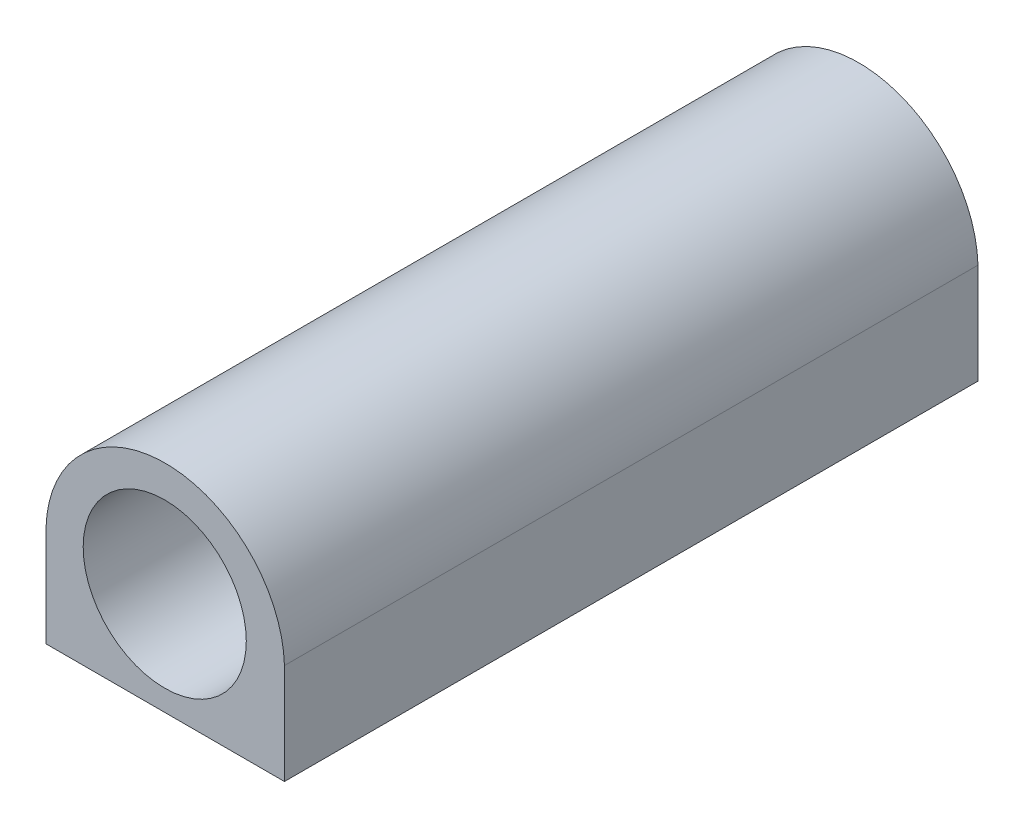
ISO-10303-21;
HEADER;
FILE_DESCRIPTION(('STEP AP214'),'2;1');
FILE_NAME('part.step','',(''),(''),'','','');
FILE_SCHEMA(('AUTOMOTIVE_DESIGN { 1 0 10303 214 1 1 1 1 }'));
ENDSEC;
DATA;
#1=APPLICATION_CONTEXT('core data for automotive mechanical design processes');
#2=APPLICATION_PROTOCOL_DEFINITION('international standard','automotive_design',2000,#1);
#3=PRODUCT_CONTEXT('',#1,'mechanical');
#4=PRODUCT('Part','Part','',(#3));
#5=PRODUCT_RELATED_PRODUCT_CATEGORY('part','',(#4));
#6=PRODUCT_DEFINITION_FORMATION('','',#4);
#7=PRODUCT_DEFINITION_CONTEXT('part definition',#1,'design');
#8=PRODUCT_DEFINITION('design','',#6,#7);
#9=PRODUCT_DEFINITION_SHAPE('','',#8);
#10=(LENGTH_UNIT() NAMED_UNIT(*) SI_UNIT(.MILLI.,.METRE.));
#11=(NAMED_UNIT(*) PLANE_ANGLE_UNIT() SI_UNIT($,.RADIAN.));
#12=(NAMED_UNIT(*) SI_UNIT($,.STERADIAN.) SOLID_ANGLE_UNIT());
#13=UNCERTAINTY_MEASURE_WITH_UNIT(LENGTH_MEASURE(1.E-05),#10,'distance_accuracy_value','');
#14=(GEOMETRIC_REPRESENTATION_CONTEXT(3) GLOBAL_UNCERTAINTY_ASSIGNED_CONTEXT((#13)) GLOBAL_UNIT_ASSIGNED_CONTEXT((#10,
#11,#12)) REPRESENTATION_CONTEXT('',''));
#15=CARTESIAN_POINT('',(0.,0.,0.));
#16=DIRECTION('',(0.,0.,1.));
#17=DIRECTION('',(1.,0.,0.));
#18=AXIS2_PLACEMENT_3D('',#15,#16,#17);
#19=CARTESIAN_POINT('',(-76.2611931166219,40.2415150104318,-84.8470907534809));
#20=DIRECTION('',(0.,0.,1.));
#21=DIRECTION('',(1.,0.,0.));
#22=AXIS2_PLACEMENT_3D('',#19,#20,#21);
#23=CYLINDRICAL_SURFACE('',#22,12.7);
#24=CARTESIAN_POINT('',(-76.2611931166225,40.2415150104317,3.6422428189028));
#25=DIRECTION('',(0.,0.,1.));
#26=DIRECTION('',(1.,0.,0.));
#27=AXIS2_PLACEMENT_3D('',#24,#25,#26);
#28=CIRCLE('',#27,12.7);
#29=CARTESIAN_POINT('',(-63.5611931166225,40.2415150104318,3.6422428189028));
#30=VERTEX_POINT('',#29);
#31=EDGE_CURVE('E10',#30,#30,#28,.T.);
#32=ORIENTED_EDGE('',*,*,#31,.T.);
#33=EDGE_LOOP('',(#32));
#34=FACE_BOUND('',#33,.T.);
#35=CARTESIAN_POINT('',(-76.2611931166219,40.2415150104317,-84.8470907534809));
#36=DIRECTION('',(0.,0.,-1.));
#37=DIRECTION('',(0.,-1.,0.));
#38=AXIS2_PLACEMENT_3D('',#35,#36,#37);
#39=CIRCLE('',#38,12.7);
#40=CARTESIAN_POINT('',(-76.2611931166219,27.5415150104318,-84.8470907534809));
#41=VERTEX_POINT('',#40);
#42=EDGE_CURVE('E26',#41,#41,#39,.T.);
#43=ORIENTED_EDGE('',*,*,#42,.T.);
#44=EDGE_LOOP('',(#43));
#45=FACE_BOUND('',#44,.T.);
#46=ADVANCED_FACE('F16',(#34,#45),#23,.F.);
#47=CARTESIAN_POINT('',(-545.084032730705,24.2776075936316,245.712893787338));
#48=DIRECTION('',(0.,-1.,0.));
#49=DIRECTION('',(1.,0.,0.));
#50=AXIS2_PLACEMENT_3D('',#47,#48,#49);
#51=PLANE('',#50);
#52=DIRECTION('',(1.,0.,0.));
#53=VECTOR('',#52,1.);
#54=CARTESIAN_POINT('',(-94.7515980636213,24.2776075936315,3.64224281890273));
#55=LINE('',#54,#53);
#56=CARTESIAN_POINT('',(-94.7515980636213,24.2776075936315,3.64224281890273));
#57=VERTEX_POINT('',#56);
#58=CARTESIAN_POINT('',(-57.6183881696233,24.2776075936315,3.64224281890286));
#59=VERTEX_POINT('',#58);
#60=EDGE_CURVE('E83',#57,#59,#55,.T.);
#61=ORIENTED_EDGE('',*,*,#60,.F.);
#62=DIRECTION('',(0.,0.,1.));
#63=VECTOR('',#62,1.);
#64=CARTESIAN_POINT('',(-94.7515980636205,24.2776075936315,-104.357657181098));
#65=LINE('',#64,#63);
#66=CARTESIAN_POINT('',(-94.7515980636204,24.2776075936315,-104.357657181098));
#67=VERTEX_POINT('',#66);
#68=EDGE_CURVE('E35',#67,#57,#65,.T.);
#69=ORIENTED_EDGE('',*,*,#68,.F.);
#70=DIRECTION('',(-1.,0.,0.));
#71=VECTOR('',#70,1.);
#72=CARTESIAN_POINT('',(-57.6183881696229,24.2776075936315,-104.357657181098));
#73=LINE('',#72,#71);
#74=CARTESIAN_POINT('',(-57.6183881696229,24.2776075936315,-104.357657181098));
#75=VERTEX_POINT('',#74);
#76=EDGE_CURVE('E71',#75,#67,#73,.T.);
#77=ORIENTED_EDGE('',*,*,#76,.F.);
#78=DIRECTION('',(0.,0.,1.));
#79=VECTOR('',#78,1.);
#80=CARTESIAN_POINT('',(-57.618388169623,24.2776075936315,-104.357657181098));
#81=LINE('',#80,#79);
#82=EDGE_CURVE('E86',#75,#59,#81,.T.);
#83=ORIENTED_EDGE('',*,*,#82,.T.);
#84=EDGE_LOOP('',(#61,#69,#77,#83));
#85=FACE_BOUND('',#84,.T.);
#86=CARTESIAN_POINT('',(-76.1849931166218,24.2776075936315,-89.3576571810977));
#87=DIRECTION('',(0.,-1.,0.));
#88=DIRECTION('',(-1.,0.,0.));
#89=AXIS2_PLACEMENT_3D('',#86,#87,#88);
#90=CIRCLE('',#89,2.);
#91=CARTESIAN_POINT('',(-78.1849931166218,24.2776075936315,-89.3576571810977));
#92=VERTEX_POINT('',#91);
#93=EDGE_CURVE('E90',#92,#92,#90,.T.);
#94=ORIENTED_EDGE('',*,*,#93,.F.);
#95=EDGE_LOOP('',(#94));
#96=FACE_BOUND('',#95,.T.);
#97=CARTESIAN_POINT('',(-85.4682955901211,24.2776075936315,-99.3576571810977));
#98=DIRECTION('',(0.,-1.,0.));
#99=DIRECTION('',(-1.,0.,0.));
#100=AXIS2_PLACEMENT_3D('',#97,#98,#99);
#101=CIRCLE('',#100,2.);
#102=CARTESIAN_POINT('',(-87.4682955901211,24.2776075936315,-99.3576571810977));
#103=VERTEX_POINT('',#102);
#104=EDGE_CURVE('E95',#103,#103,#101,.T.);
#105=ORIENTED_EDGE('',*,*,#104,.F.);
#106=EDGE_LOOP('',(#105));
#107=FACE_BOUND('',#106,.T.);
#108=CARTESIAN_POINT('',(-66.9016906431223,24.2776075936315,-99.3576571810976));
#109=DIRECTION('',(0.,-1.,0.));
#110=DIRECTION('',(-1.,0.,0.));
#111=AXIS2_PLACEMENT_3D('',#108,#109,#110);
#112=CIRCLE('',#111,2.);
#113=CARTESIAN_POINT('',(-68.9016906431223,24.2776075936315,-99.3576571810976));
#114=VERTEX_POINT('',#113);
#115=EDGE_CURVE('E99',#114,#114,#112,.T.);
#116=ORIENTED_EDGE('',*,*,#115,.F.);
#117=EDGE_LOOP('',(#116));
#118=FACE_BOUND('',#117,.T.);
#119=CARTESIAN_POINT('',(-76.1849931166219,24.2776075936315,-79.3576571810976));
#120=DIRECTION('',(0.,-1.,0.));
#121=DIRECTION('',(-1.,0.,0.));
#122=AXIS2_PLACEMENT_3D('',#119,#120,#121);
#123=CIRCLE('',#122,2.);
#124=CARTESIAN_POINT('',(-78.1849931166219,24.2776075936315,-79.3576571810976));
#125=VERTEX_POINT('',#124);
#126=EDGE_CURVE('E102',#125,#125,#123,.T.);
#127=ORIENTED_EDGE('',*,*,#126,.F.);
#128=EDGE_LOOP('',(#127));
#129=FACE_BOUND('',#128,.T.);
#130=CARTESIAN_POINT('',(-85.4682955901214,24.2776075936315,-69.3576571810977));
#131=DIRECTION('',(0.,-1.,0.));
#132=DIRECTION('',(-1.,0.,0.));
#133=AXIS2_PLACEMENT_3D('',#130,#131,#132);
#134=CIRCLE('',#133,2.);
#135=CARTESIAN_POINT('',(-87.4682955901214,24.2776075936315,-69.3576571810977));
#136=VERTEX_POINT('',#135);
#137=EDGE_CURVE('E107',#136,#136,#134,.T.);
#138=ORIENTED_EDGE('',*,*,#137,.F.);
#139=EDGE_LOOP('',(#138));
#140=FACE_BOUND('',#139,.T.);
#141=CARTESIAN_POINT('',(-66.9016906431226,24.2776075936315,-69.3576571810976));
#142=DIRECTION('',(0.,-1.,0.));
#143=DIRECTION('',(-1.,0.,0.));
#144=AXIS2_PLACEMENT_3D('',#141,#142,#143);
#145=CIRCLE('',#144,2.);
#146=CARTESIAN_POINT('',(-68.9016906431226,24.2776075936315,-69.3576571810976));
#147=VERTEX_POINT('',#146);
#148=EDGE_CURVE('E111',#147,#147,#145,.T.);
#149=ORIENTED_EDGE('',*,*,#148,.F.);
#150=EDGE_LOOP('',(#149));
#151=FACE_BOUND('',#150,.T.);
#152=CARTESIAN_POINT('',(-76.1849931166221,24.2776075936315,-59.3576571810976));
#153=DIRECTION('',(0.,-1.,0.));
#154=DIRECTION('',(-1.,0.,0.));
#155=AXIS2_PLACEMENT_3D('',#152,#153,#154);
#156=CIRCLE('',#155,2.);
#157=CARTESIAN_POINT('',(-78.1849931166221,24.2776075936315,-59.3576571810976));
#158=VERTEX_POINT('',#157);
#159=EDGE_CURVE('E115',#158,#158,#156,.T.);
#160=ORIENTED_EDGE('',*,*,#159,.F.);
#161=EDGE_LOOP('',(#160));
#162=FACE_BOUND('',#161,.T.);
#163=CARTESIAN_POINT('',(-85.4682955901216,24.2776075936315,-49.3576571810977));
#164=DIRECTION('',(0.,-1.,0.));
#165=DIRECTION('',(-1.,0.,0.));
#166=AXIS2_PLACEMENT_3D('',#163,#164,#165);
#167=CIRCLE('',#166,2.);
#168=CARTESIAN_POINT('',(-87.4682955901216,24.2776075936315,-49.3576571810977));
#169=VERTEX_POINT('',#168);
#170=EDGE_CURVE('E119',#169,#169,#167,.T.);
#171=ORIENTED_EDGE('',*,*,#170,.F.);
#172=EDGE_LOOP('',(#171));
#173=FACE_BOUND('',#172,.T.);
#174=CARTESIAN_POINT('',(-66.9016906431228,24.2776075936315,-49.3576571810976));
#175=DIRECTION('',(0.,-1.,0.));
#176=DIRECTION('',(-1.,0.,0.));
#177=AXIS2_PLACEMENT_3D('',#174,#175,#176);
#178=CIRCLE('',#177,2.);
#179=CARTESIAN_POINT('',(-68.9016906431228,24.2776075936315,-49.3576571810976));
#180=VERTEX_POINT('',#179);
#181=EDGE_CURVE('E123',#180,#180,#178,.T.);
#182=ORIENTED_EDGE('',*,*,#181,.F.);
#183=EDGE_LOOP('',(#182));
#184=FACE_BOUND('',#183,.T.);
#185=CARTESIAN_POINT('',(-76.1849931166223,24.2776075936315,-39.3576571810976));
#186=DIRECTION('',(0.,-1.,0.));
#187=DIRECTION('',(-1.,0.,0.));
#188=AXIS2_PLACEMENT_3D('',#185,#186,#187);
#189=CIRCLE('',#188,2.);
#190=CARTESIAN_POINT('',(-78.1849931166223,24.2776075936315,-39.3576571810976));
#191=VERTEX_POINT('',#190);
#192=EDGE_CURVE('E127',#191,#191,#189,.T.);
#193=ORIENTED_EDGE('',*,*,#192,.F.);
#194=EDGE_LOOP('',(#193));
#195=FACE_BOUND('',#194,.T.);
#196=CARTESIAN_POINT('',(-85.4682955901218,24.2776075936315,-29.3576571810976));
#197=DIRECTION('',(0.,-1.,0.));
#198=DIRECTION('',(-1.,0.,0.));
#199=AXIS2_PLACEMENT_3D('',#196,#197,#198);
#200=CIRCLE('',#199,2.);
#201=CARTESIAN_POINT('',(-87.4682955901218,24.2776075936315,-29.3576571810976));
#202=VERTEX_POINT('',#201);
#203=EDGE_CURVE('E131',#202,#202,#200,.T.);
#204=ORIENTED_EDGE('',*,*,#203,.F.);
#205=EDGE_LOOP('',(#204));
#206=FACE_BOUND('',#205,.T.);
#207=CARTESIAN_POINT('',(-66.9016906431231,24.2776075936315,-29.3576571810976));
#208=DIRECTION('',(0.,-1.,0.));
#209=DIRECTION('',(-1.,0.,0.));
#210=AXIS2_PLACEMENT_3D('',#207,#208,#209);
#211=CIRCLE('',#210,2.);
#212=CARTESIAN_POINT('',(-68.9016906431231,24.2776075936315,-29.3576571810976));
#213=VERTEX_POINT('',#212);
#214=EDGE_CURVE('E135',#213,#213,#211,.T.);
#215=ORIENTED_EDGE('',*,*,#214,.F.);
#216=EDGE_LOOP('',(#215));
#217=FACE_BOUND('',#216,.T.);
#218=CARTESIAN_POINT('',(-76.1849931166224,24.2776075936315,-29.3576571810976));
#219=DIRECTION('',(0.,-1.,0.));
#220=DIRECTION('',(-1.,0.,0.));
#221=AXIS2_PLACEMENT_3D('',#218,#219,#220);
#222=CIRCLE('',#221,2.);
#223=CARTESIAN_POINT('',(-78.1849931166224,24.2776075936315,-29.3576571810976));
#224=VERTEX_POINT('',#223);
#225=EDGE_CURVE('E134',#224,#224,#222,.T.);
#226=ORIENTED_EDGE('',*,*,#225,.F.);
#227=EDGE_LOOP('',(#226));
#228=FACE_BOUND('',#227,.T.);
#229=CARTESIAN_POINT('',(-66.901690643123,24.2776075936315,-39.3576571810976));
#230=DIRECTION('',(0.,-1.,0.));
#231=DIRECTION('',(-1.,0.,0.));
#232=AXIS2_PLACEMENT_3D('',#229,#230,#231);
#233=CIRCLE('',#232,2.);
#234=CARTESIAN_POINT('',(-68.901690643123,24.2776075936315,-39.3576571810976));
#235=VERTEX_POINT('',#234);
#236=EDGE_CURVE('E126',#235,#235,#233,.T.);
#237=ORIENTED_EDGE('',*,*,#236,.F.);
#238=EDGE_LOOP('',(#237));
#239=FACE_BOUND('',#238,.T.);
#240=CARTESIAN_POINT('',(-85.4682955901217,24.2776075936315,-39.3576571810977));
#241=DIRECTION('',(0.,-1.,0.));
#242=DIRECTION('',(-1.,0.,0.));
#243=AXIS2_PLACEMENT_3D('',#240,#241,#242);
#244=CIRCLE('',#243,2.);
#245=CARTESIAN_POINT('',(-87.4682955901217,24.2776075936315,-39.3576571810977));
#246=VERTEX_POINT('',#245);
#247=EDGE_CURVE('E130',#246,#246,#244,.T.);
#248=ORIENTED_EDGE('',*,*,#247,.F.);
#249=EDGE_LOOP('',(#248));
#250=FACE_BOUND('',#249,.T.);
#251=CARTESIAN_POINT('',(-76.1849931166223,24.2776075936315,-49.3576571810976));
#252=DIRECTION('',(0.,-1.,0.));
#253=DIRECTION('',(-1.,0.,0.));
#254=AXIS2_PLACEMENT_3D('',#251,#252,#253);
#255=CIRCLE('',#254,2.);
#256=CARTESIAN_POINT('',(-78.1849931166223,24.2776075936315,-49.3576571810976));
#257=VERTEX_POINT('',#256);
#258=EDGE_CURVE('E122',#257,#257,#255,.T.);
#259=ORIENTED_EDGE('',*,*,#258,.F.);
#260=EDGE_LOOP('',(#259));
#261=FACE_BOUND('',#260,.T.);
#262=CARTESIAN_POINT('',(-66.9016906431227,24.2776075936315,-59.3576571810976));
#263=DIRECTION('',(0.,-1.,0.));
#264=DIRECTION('',(-1.,0.,0.));
#265=AXIS2_PLACEMENT_3D('',#262,#263,#264);
#266=CIRCLE('',#265,2.);
#267=CARTESIAN_POINT('',(-68.9016906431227,24.2776075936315,-59.3576571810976));
#268=VERTEX_POINT('',#267);
#269=EDGE_CURVE('E114',#268,#268,#266,.T.);
#270=ORIENTED_EDGE('',*,*,#269,.F.);
#271=EDGE_LOOP('',(#270));
#272=FACE_BOUND('',#271,.T.);
#273=CARTESIAN_POINT('',(-85.4682955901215,24.2776075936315,-59.3576571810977));
#274=DIRECTION('',(0.,-1.,0.));
#275=DIRECTION('',(-1.,0.,0.));
#276=AXIS2_PLACEMENT_3D('',#273,#274,#275);
#277=CIRCLE('',#276,2.);
#278=CARTESIAN_POINT('',(-87.4682955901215,24.2776075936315,-59.3576571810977));
#279=VERTEX_POINT('',#278);
#280=EDGE_CURVE('E118',#279,#279,#277,.T.);
#281=ORIENTED_EDGE('',*,*,#280,.F.);
#282=EDGE_LOOP('',(#281));
#283=FACE_BOUND('',#282,.T.);
#284=CARTESIAN_POINT('',(-76.184993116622,24.2776075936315,-69.3576571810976));
#285=DIRECTION('',(0.,-1.,0.));
#286=DIRECTION('',(-1.,0.,0.));
#287=AXIS2_PLACEMENT_3D('',#284,#285,#286);
#288=CIRCLE('',#287,2.);
#289=CARTESIAN_POINT('',(-78.184993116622,24.2776075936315,-69.3576571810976));
#290=VERTEX_POINT('',#289);
#291=EDGE_CURVE('E110',#290,#290,#288,.T.);
#292=ORIENTED_EDGE('',*,*,#291,.F.);
#293=EDGE_LOOP('',(#292));
#294=FACE_BOUND('',#293,.T.);
#295=CARTESIAN_POINT('',(-66.9016906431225,24.2776075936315,-79.3576571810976));
#296=DIRECTION('',(0.,-1.,0.));
#297=DIRECTION('',(-1.,0.,0.));
#298=AXIS2_PLACEMENT_3D('',#295,#296,#297);
#299=CIRCLE('',#298,2.);
#300=CARTESIAN_POINT('',(-68.9016906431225,24.2776075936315,-79.3576571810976));
#301=VERTEX_POINT('',#300);
#302=EDGE_CURVE('E105',#301,#301,#299,.T.);
#303=ORIENTED_EDGE('',*,*,#302,.F.);
#304=EDGE_LOOP('',(#303));
#305=FACE_BOUND('',#304,.T.);
#306=CARTESIAN_POINT('',(-85.4682955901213,24.2776075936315,-79.3576571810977));
#307=DIRECTION('',(0.,-1.,0.));
#308=DIRECTION('',(-1.,0.,0.));
#309=AXIS2_PLACEMENT_3D('',#306,#307,#308);
#310=CIRCLE('',#309,2.);
#311=CARTESIAN_POINT('',(-87.4682955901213,24.2776075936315,-79.3576571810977));
#312=VERTEX_POINT('',#311);
#313=EDGE_CURVE('E106',#312,#312,#310,.T.);
#314=ORIENTED_EDGE('',*,*,#313,.F.);
#315=EDGE_LOOP('',(#314));
#316=FACE_BOUND('',#315,.T.);
#317=CARTESIAN_POINT('',(-76.1849931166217,24.2776075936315,-99.3576571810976));
#318=DIRECTION('',(0.,-1.,0.));
#319=DIRECTION('',(-1.,0.,0.));
#320=AXIS2_PLACEMENT_3D('',#317,#318,#319);
#321=CIRCLE('',#320,2.);
#322=CARTESIAN_POINT('',(-78.1849931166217,24.2776075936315,-99.3576571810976));
#323=VERTEX_POINT('',#322);
#324=EDGE_CURVE('E98',#323,#323,#321,.T.);
#325=ORIENTED_EDGE('',*,*,#324,.F.);
#326=EDGE_LOOP('',(#325));
#327=FACE_BOUND('',#326,.T.);
#328=CARTESIAN_POINT('',(-66.9016906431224,24.2776075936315,-89.3576571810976));
#329=DIRECTION('',(0.,-1.,0.));
#330=DIRECTION('',(-1.,0.,0.));
#331=AXIS2_PLACEMENT_3D('',#328,#329,#330);
#332=CIRCLE('',#331,2.);
#333=CARTESIAN_POINT('',(-68.9016906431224,24.2776075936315,-89.3576571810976));
#334=VERTEX_POINT('',#333);
#335=EDGE_CURVE('E94',#334,#334,#332,.T.);
#336=ORIENTED_EDGE('',*,*,#335,.F.);
#337=EDGE_LOOP('',(#336));
#338=FACE_BOUND('',#337,.T.);
#339=CARTESIAN_POINT('',(-85.4682955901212,24.2776075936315,-89.3576571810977));
#340=DIRECTION('',(0.,-1.,0.));
#341=DIRECTION('',(-1.,0.,0.));
#342=AXIS2_PLACEMENT_3D('',#339,#340,#341);
#343=CIRCLE('',#342,2.);
#344=CARTESIAN_POINT('',(-87.4682955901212,24.2776075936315,-89.3576571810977));
#345=VERTEX_POINT('',#344);
#346=EDGE_CURVE('E93',#345,#345,#343,.T.);
#347=ORIENTED_EDGE('',*,*,#346,.F.);
#348=EDGE_LOOP('',(#347));
#349=FACE_BOUND('',#348,.T.);
#350=ADVANCED_FACE('F168',(#85,#96,#107,#118,#129,#140,#151,#162,#173,#184,#195,#206,#217,#228,
#239,#250,#261,#272,#283,#294,#305,#316,#327,#338,#349),#51,.T.);
#351=CARTESIAN_POINT('',(-395.135613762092,-37.3692409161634,3.64224281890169));
#352=DIRECTION('',(0.,0.,-1.));
#353=DIRECTION('',(-1.,0.,0.));
#354=AXIS2_PLACEMENT_3D('',#351,#352,#353);
#355=PLANE('',#354);
#356=DIRECTION('',(0.,-1.,0.));
#357=VECTOR('',#356,1.);
#358=CARTESIAN_POINT('',(-57.6183881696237,39.9190032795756,3.64224281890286));
#359=LINE('',#358,#357);
#360=CARTESIAN_POINT('',(-57.6183881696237,39.9190032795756,3.64224281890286));
#361=VERTEX_POINT('',#360);
#362=EDGE_CURVE('E77',#361,#59,#359,.T.);
#363=ORIENTED_EDGE('',*,*,#362,.F.);
#364=CARTESIAN_POINT('',(-76.1849931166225,39.3606075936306,3.6422428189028));
#365=DIRECTION('',(0.,0.,1.));
#366=DIRECTION('',(1.,0.,0.));
#367=AXIS2_PLACEMENT_3D('',#364,#365,#366);
#368=CIRCLE('',#367,18.575);
#369=CARTESIAN_POINT('',(-94.7515980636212,39.9190032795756,3.64224281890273));
#370=VERTEX_POINT('',#369);
#371=EDGE_CURVE('E89',#361,#370,#368,.T.);
#372=ORIENTED_EDGE('',*,*,#371,.T.);
#373=DIRECTION('',(0.,-1.,0.));
#374=VECTOR('',#373,1.);
#375=CARTESIAN_POINT('',(-94.7515980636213,39.9190032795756,3.64224281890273));
#376=LINE('',#375,#374);
#377=EDGE_CURVE('E75',#370,#57,#376,.T.);
#378=ORIENTED_EDGE('',*,*,#377,.T.);
#379=ORIENTED_EDGE('',*,*,#60,.T.);
#380=EDGE_LOOP('',(#363,#372,#378,#379));
#381=FACE_BOUND('',#380,.T.);
#382=ORIENTED_EDGE('',*,*,#31,.F.);
#383=EDGE_LOOP('',(#382));
#384=FACE_BOUND('',#383,.T.);
#385=ADVANCED_FACE('F165',(#381,#384),#355,.F.);
#386=CARTESIAN_POINT('',(-64.4679931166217,-8.53002930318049,-104.357657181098));
#387=DIRECTION('',(0.,0.,-1.));
#388=DIRECTION('',(-1.,0.,0.));
#389=AXIS2_PLACEMENT_3D('',#386,#387,#388);
#390=PLANE('',#389);
#391=DIRECTION('',(0.,1.,0.));
#392=VECTOR('',#391,1.);
#393=CARTESIAN_POINT('',(-57.6183881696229,24.2776075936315,-104.357657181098));
#394=LINE('',#393,#392);
#395=CARTESIAN_POINT('',(-57.618388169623,39.9190032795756,-104.357657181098));
#396=VERTEX_POINT('',#395);
#397=EDGE_CURVE('E55',#75,#396,#394,.T.);
#398=ORIENTED_EDGE('',*,*,#397,.F.);
#399=ORIENTED_EDGE('',*,*,#76,.T.);
#400=DIRECTION('',(0.,1.,0.));
#401=VECTOR('',#400,1.);
#402=CARTESIAN_POINT('',(-94.7515980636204,24.2776075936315,-104.357657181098));
#403=LINE('',#402,#401);
#404=CARTESIAN_POINT('',(-94.7515980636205,39.9190032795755,-104.357657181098));
#405=VERTEX_POINT('',#404);
#406=EDGE_CURVE('E69',#67,#405,#403,.T.);
#407=ORIENTED_EDGE('',*,*,#406,.T.);
#408=CARTESIAN_POINT('',(-76.1849931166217,39.3606075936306,-104.357657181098));
#409=DIRECTION('',(0.,0.,1.));
#410=DIRECTION('',(1.,0.,0.));
#411=AXIS2_PLACEMENT_3D('',#408,#409,#410);
#412=CIRCLE('',#411,18.575);
#413=EDGE_CURVE('E61',#396,#405,#412,.T.);
#414=ORIENTED_EDGE('',*,*,#413,.F.);
#415=EDGE_LOOP('',(#398,#399,#407,#414));
#416=FACE_BOUND('',#415,.T.);
#417=ADVANCED_FACE('F70',(#416),#390,.T.);
#418=CARTESIAN_POINT('',(-76.1849931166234,39.3606075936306,133.642342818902));
#419=DIRECTION('',(0.,0.,-1.));
#420=DIRECTION('',(0.,-1.,0.));
#421=AXIS2_PLACEMENT_3D('',#418,#419,#420);
#422=CYLINDRICAL_SURFACE('',#421,18.575);
#423=ORIENTED_EDGE('',*,*,#371,.F.);
#424=DIRECTION('',(0.,0.,-1.));
#425=VECTOR('',#424,1.);
#426=CARTESIAN_POINT('',(-57.6183881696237,39.9190032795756,3.64224281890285));
#427=LINE('',#426,#425);
#428=EDGE_CURVE('E65',#361,#396,#427,.T.);
#429=ORIENTED_EDGE('',*,*,#428,.T.);
#430=ORIENTED_EDGE('',*,*,#413,.T.);
#431=DIRECTION('',(0.,0.,-1.));
#432=VECTOR('',#431,1.);
#433=CARTESIAN_POINT('',(-94.7515980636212,39.9190032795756,3.64224281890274));
#434=LINE('',#433,#432);
#435=EDGE_CURVE('E20',#370,#405,#434,.T.);
#436=ORIENTED_EDGE('',*,*,#435,.F.);
#437=EDGE_LOOP('',(#423,#429,#430,#436));
#438=FACE_BOUND('',#437,.T.);
#439=ADVANCED_FACE('F18',(#438),#422,.T.);
#440=CARTESIAN_POINT('',(-94.751598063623,12.1578375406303,248.88781943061));
#441=DIRECTION('',(-1.,0.,0.));
#442=DIRECTION('',(0.,0.,1.));
#443=AXIS2_PLACEMENT_3D('',#440,#441,#442);
#444=PLANE('',#443);
#445=ORIENTED_EDGE('',*,*,#377,.F.);
#446=ORIENTED_EDGE('',*,*,#435,.T.);
#447=ORIENTED_EDGE('',*,*,#406,.F.);
#448=ORIENTED_EDGE('',*,*,#68,.T.);
#449=EDGE_LOOP('',(#445,#446,#447,#448));
#450=FACE_BOUND('',#449,.T.);
#451=ADVANCED_FACE('F73',(#450),#444,.T.);
#452=CARTESIAN_POINT('',(-57.6183881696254,12.1578375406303,248.88781943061));
#453=DIRECTION('',(-1.,0.,0.));
#454=DIRECTION('',(0.,0.,1.));
#455=AXIS2_PLACEMENT_3D('',#452,#453,#454);
#456=PLANE('',#455);
#457=ORIENTED_EDGE('',*,*,#428,.F.);
#458=ORIENTED_EDGE('',*,*,#362,.T.);
#459=ORIENTED_EDGE('',*,*,#82,.F.);
#460=ORIENTED_EDGE('',*,*,#397,.T.);
#461=EDGE_LOOP('',(#457,#458,#459,#460));
#462=FACE_BOUND('',#461,.T.);
#463=ADVANCED_FACE('F170',(#462),#456,.F.);
#464=CARTESIAN_POINT('',(-201.228799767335,40.2415150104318,-84.8470907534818));
#465=DIRECTION('',(0.,0.,1.));
#466=DIRECTION('',(1.,0.,0.));
#467=AXIS2_PLACEMENT_3D('',#464,#465,#466);
#468=PLANE('',#467);
#469=ORIENTED_EDGE('',*,*,#42,.F.);
#470=EDGE_LOOP('',(#469));
#471=FACE_BOUND('',#470,.T.);
#472=ADVANCED_FACE('F172',(#471),#468,.T.);
#473=CARTESIAN_POINT('',(-85.4682955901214,24.2776075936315,-69.3576571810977));
#474=DIRECTION('',(0.,1.,0.));
#475=DIRECTION('',(0.,0.,-1.));
#476=AXIS2_PLACEMENT_3D('',#473,#474,#475);
#477=SPHERICAL_SURFACE('',#476,2.);
#478=ORIENTED_EDGE('',*,*,#137,.T.);
#479=EDGE_LOOP('',(#478));
#480=FACE_BOUND('',#479,.T.);
#481=ADVANCED_FACE('F179',(#480),#477,.T.);
#482=CARTESIAN_POINT('',(-76.184993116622,24.2776075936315,-69.3576571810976));
#483=DIRECTION('',(0.,1.,0.));
#484=DIRECTION('',(0.,0.,-1.));
#485=AXIS2_PLACEMENT_3D('',#482,#483,#484);
#486=SPHERICAL_SURFACE('',#485,2.);
#487=ORIENTED_EDGE('',*,*,#291,.T.);
#488=EDGE_LOOP('',(#487));
#489=FACE_BOUND('',#488,.T.);
#490=ADVANCED_FACE('F278',(#489),#486,.T.);
#491=CARTESIAN_POINT('',(-76.1849931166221,24.2776075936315,-59.3576571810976));
#492=DIRECTION('',(0.,1.,0.));
#493=DIRECTION('',(0.,0.,-1.));
#494=AXIS2_PLACEMENT_3D('',#491,#492,#493);
#495=SPHERICAL_SURFACE('',#494,2.);
#496=ORIENTED_EDGE('',*,*,#159,.T.);
#497=EDGE_LOOP('',(#496));
#498=FACE_BOUND('',#497,.T.);
#499=ADVANCED_FACE('F274',(#498),#495,.T.);
#500=CARTESIAN_POINT('',(-85.4682955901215,24.2776075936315,-59.3576571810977));
#501=DIRECTION('',(0.,1.,0.));
#502=DIRECTION('',(0.,0.,-1.));
#503=AXIS2_PLACEMENT_3D('',#500,#501,#502);
#504=SPHERICAL_SURFACE('',#503,2.);
#505=ORIENTED_EDGE('',*,*,#280,.T.);
#506=EDGE_LOOP('',(#505));
#507=FACE_BOUND('',#506,.T.);
#508=ADVANCED_FACE('F270',(#507),#504,.T.);
#509=CARTESIAN_POINT('',(-85.4682955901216,24.2776075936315,-49.3576571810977));
#510=DIRECTION('',(0.,1.,0.));
#511=DIRECTION('',(0.,0.,-1.));
#512=AXIS2_PLACEMENT_3D('',#509,#510,#511);
#513=SPHERICAL_SURFACE('',#512,2.);
#514=ORIENTED_EDGE('',*,*,#170,.T.);
#515=EDGE_LOOP('',(#514));
#516=FACE_BOUND('',#515,.T.);
#517=ADVANCED_FACE('F266',(#516),#513,.T.);
#518=CARTESIAN_POINT('',(-76.1849931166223,24.2776075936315,-49.3576571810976));
#519=DIRECTION('',(0.,1.,0.));
#520=DIRECTION('',(0.,0.,-1.));
#521=AXIS2_PLACEMENT_3D('',#518,#519,#520);
#522=SPHERICAL_SURFACE('',#521,2.);
#523=ORIENTED_EDGE('',*,*,#258,.T.);
#524=EDGE_LOOP('',(#523));
#525=FACE_BOUND('',#524,.T.);
#526=ADVANCED_FACE('F262',(#525),#522,.T.);
#527=CARTESIAN_POINT('',(-76.1849931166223,24.2776075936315,-39.3576571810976));
#528=DIRECTION('',(0.,1.,0.));
#529=DIRECTION('',(0.,0.,-1.));
#530=AXIS2_PLACEMENT_3D('',#527,#528,#529);
#531=SPHERICAL_SURFACE('',#530,2.);
#532=ORIENTED_EDGE('',*,*,#192,.T.);
#533=EDGE_LOOP('',(#532));
#534=FACE_BOUND('',#533,.T.);
#535=ADVANCED_FACE('F258',(#534),#531,.T.);
#536=CARTESIAN_POINT('',(-85.4682955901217,24.2776075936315,-39.3576571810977));
#537=DIRECTION('',(0.,1.,0.));
#538=DIRECTION('',(0.,0.,-1.));
#539=AXIS2_PLACEMENT_3D('',#536,#537,#538);
#540=SPHERICAL_SURFACE('',#539,2.);
#541=ORIENTED_EDGE('',*,*,#247,.T.);
#542=EDGE_LOOP('',(#541));
#543=FACE_BOUND('',#542,.T.);
#544=ADVANCED_FACE('F254',(#543),#540,.T.);
#545=CARTESIAN_POINT('',(-85.4682955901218,24.2776075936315,-29.3576571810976));
#546=DIRECTION('',(0.,1.,0.));
#547=DIRECTION('',(0.,0.,-1.));
#548=AXIS2_PLACEMENT_3D('',#545,#546,#547);
#549=SPHERICAL_SURFACE('',#548,2.);
#550=ORIENTED_EDGE('',*,*,#203,.T.);
#551=EDGE_LOOP('',(#550));
#552=FACE_BOUND('',#551,.T.);
#553=ADVANCED_FACE('F250',(#552),#549,.T.);
#554=CARTESIAN_POINT('',(-76.1849931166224,24.2776075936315,-29.3576571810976));
#555=DIRECTION('',(0.,1.,0.));
#556=DIRECTION('',(0.,0.,-1.));
#557=AXIS2_PLACEMENT_3D('',#554,#555,#556);
#558=SPHERICAL_SURFACE('',#557,2.);
#559=ORIENTED_EDGE('',*,*,#225,.T.);
#560=EDGE_LOOP('',(#559));
#561=FACE_BOUND('',#560,.T.);
#562=ADVANCED_FACE('F246',(#561),#558,.T.);
#563=CARTESIAN_POINT('',(-66.9016906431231,24.2776075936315,-29.3576571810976));
#564=DIRECTION('',(0.,1.,0.));
#565=DIRECTION('',(0.,0.,-1.));
#566=AXIS2_PLACEMENT_3D('',#563,#564,#565);
#567=SPHERICAL_SURFACE('',#566,2.);
#568=ORIENTED_EDGE('',*,*,#214,.T.);
#569=EDGE_LOOP('',(#568));
#570=FACE_BOUND('',#569,.T.);
#571=ADVANCED_FACE('F242',(#570),#567,.T.);
#572=CARTESIAN_POINT('',(-66.901690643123,24.2776075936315,-39.3576571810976));
#573=DIRECTION('',(0.,1.,0.));
#574=DIRECTION('',(0.,0.,-1.));
#575=AXIS2_PLACEMENT_3D('',#572,#573,#574);
#576=SPHERICAL_SURFACE('',#575,2.);
#577=ORIENTED_EDGE('',*,*,#236,.T.);
#578=EDGE_LOOP('',(#577));
#579=FACE_BOUND('',#578,.T.);
#580=ADVANCED_FACE('F238',(#579),#576,.T.);
#581=CARTESIAN_POINT('',(-66.9016906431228,24.2776075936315,-49.3576571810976));
#582=DIRECTION('',(0.,1.,0.));
#583=DIRECTION('',(0.,0.,-1.));
#584=AXIS2_PLACEMENT_3D('',#581,#582,#583);
#585=SPHERICAL_SURFACE('',#584,2.);
#586=ORIENTED_EDGE('',*,*,#181,.T.);
#587=EDGE_LOOP('',(#586));
#588=FACE_BOUND('',#587,.T.);
#589=ADVANCED_FACE('F234',(#588),#585,.T.);
#590=CARTESIAN_POINT('',(-66.9016906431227,24.2776075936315,-59.3576571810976));
#591=DIRECTION('',(0.,1.,0.));
#592=DIRECTION('',(0.,0.,-1.));
#593=AXIS2_PLACEMENT_3D('',#590,#591,#592);
#594=SPHERICAL_SURFACE('',#593,2.);
#595=ORIENTED_EDGE('',*,*,#269,.T.);
#596=EDGE_LOOP('',(#595));
#597=FACE_BOUND('',#596,.T.);
#598=ADVANCED_FACE('F230',(#597),#594,.T.);
#599=CARTESIAN_POINT('',(-66.9016906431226,24.2776075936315,-69.3576571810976));
#600=DIRECTION('',(0.,1.,0.));
#601=DIRECTION('',(0.,0.,-1.));
#602=AXIS2_PLACEMENT_3D('',#599,#600,#601);
#603=SPHERICAL_SURFACE('',#602,2.);
#604=ORIENTED_EDGE('',*,*,#148,.T.);
#605=EDGE_LOOP('',(#604));
#606=FACE_BOUND('',#605,.T.);
#607=ADVANCED_FACE('F226',(#606),#603,.T.);
#608=CARTESIAN_POINT('',(-66.9016906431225,24.2776075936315,-79.3576571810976));
#609=DIRECTION('',(0.,1.,0.));
#610=DIRECTION('',(0.,0.,-1.));
#611=AXIS2_PLACEMENT_3D('',#608,#609,#610);
#612=SPHERICAL_SURFACE('',#611,2.);
#613=ORIENTED_EDGE('',*,*,#302,.T.);
#614=EDGE_LOOP('',(#613));
#615=FACE_BOUND('',#614,.T.);
#616=ADVANCED_FACE('F222',(#615),#612,.T.);
#617=CARTESIAN_POINT('',(-76.1849931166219,24.2776075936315,-79.3576571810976));
#618=DIRECTION('',(0.,1.,0.));
#619=DIRECTION('',(0.,0.,-1.));
#620=AXIS2_PLACEMENT_3D('',#617,#618,#619);
#621=SPHERICAL_SURFACE('',#620,2.);
#622=ORIENTED_EDGE('',*,*,#126,.T.);
#623=EDGE_LOOP('',(#622));
#624=FACE_BOUND('',#623,.T.);
#625=ADVANCED_FACE('F218',(#624),#621,.T.);
#626=CARTESIAN_POINT('',(-85.4682955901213,24.2776075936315,-79.3576571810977));
#627=DIRECTION('',(0.,1.,0.));
#628=DIRECTION('',(0.,0.,-1.));
#629=AXIS2_PLACEMENT_3D('',#626,#627,#628);
#630=SPHERICAL_SURFACE('',#629,2.);
#631=ORIENTED_EDGE('',*,*,#313,.T.);
#632=EDGE_LOOP('',(#631));
#633=FACE_BOUND('',#632,.T.);
#634=ADVANCED_FACE('F214',(#633),#630,.T.);
#635=CARTESIAN_POINT('',(-85.4682955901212,24.2776075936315,-89.3576571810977));
#636=DIRECTION('',(0.,1.,0.));
#637=DIRECTION('',(0.,0.,-1.));
#638=AXIS2_PLACEMENT_3D('',#635,#636,#637);
#639=SPHERICAL_SURFACE('',#638,2.);
#640=ORIENTED_EDGE('',*,*,#346,.T.);
#641=EDGE_LOOP('',(#640));
#642=FACE_BOUND('',#641,.T.);
#643=ADVANCED_FACE('F210',(#642),#639,.T.);
#644=CARTESIAN_POINT('',(-76.1849931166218,24.2776075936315,-89.3576571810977));
#645=DIRECTION('',(0.,1.,0.));
#646=DIRECTION('',(0.,0.,-1.));
#647=AXIS2_PLACEMENT_3D('',#644,#645,#646);
#648=SPHERICAL_SURFACE('',#647,2.);
#649=ORIENTED_EDGE('',*,*,#93,.T.);
#650=EDGE_LOOP('',(#649));
#651=FACE_BOUND('',#650,.T.);
#652=ADVANCED_FACE('F206',(#651),#648,.T.);
#653=CARTESIAN_POINT('',(-66.9016906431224,24.2776075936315,-89.3576571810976));
#654=DIRECTION('',(0.,1.,0.));
#655=DIRECTION('',(0.,0.,-1.));
#656=AXIS2_PLACEMENT_3D('',#653,#654,#655);
#657=SPHERICAL_SURFACE('',#656,2.);
#658=ORIENTED_EDGE('',*,*,#335,.T.);
#659=EDGE_LOOP('',(#658));
#660=FACE_BOUND('',#659,.T.);
#661=ADVANCED_FACE('F202',(#660),#657,.T.);
#662=CARTESIAN_POINT('',(-66.9016906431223,24.2776075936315,-99.3576571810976));
#663=DIRECTION('',(0.,1.,0.));
#664=DIRECTION('',(0.,0.,-1.));
#665=AXIS2_PLACEMENT_3D('',#662,#663,#664);
#666=SPHERICAL_SURFACE('',#665,2.);
#667=ORIENTED_EDGE('',*,*,#115,.T.);
#668=EDGE_LOOP('',(#667));
#669=FACE_BOUND('',#668,.T.);
#670=ADVANCED_FACE('F198',(#669),#666,.T.);
#671=CARTESIAN_POINT('',(-76.1849931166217,24.2776075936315,-99.3576571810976));
#672=DIRECTION('',(0.,1.,0.));
#673=DIRECTION('',(0.,0.,-1.));
#674=AXIS2_PLACEMENT_3D('',#671,#672,#673);
#675=SPHERICAL_SURFACE('',#674,2.);
#676=ORIENTED_EDGE('',*,*,#324,.T.);
#677=EDGE_LOOP('',(#676));
#678=FACE_BOUND('',#677,.T.);
#679=ADVANCED_FACE('F194',(#678),#675,.T.);
#680=CARTESIAN_POINT('',(-85.4682955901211,24.2776075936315,-99.3576571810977));
#681=DIRECTION('',(0.,1.,0.));
#682=DIRECTION('',(0.,0.,-1.));
#683=AXIS2_PLACEMENT_3D('',#680,#681,#682);
#684=SPHERICAL_SURFACE('',#683,2.);
#685=ORIENTED_EDGE('',*,*,#104,.T.);
#686=EDGE_LOOP('',(#685));
#687=FACE_BOUND('',#686,.T.);
#688=ADVANCED_FACE('F191',(#687),#684,.T.);
#689=CLOSED_SHELL('',(#46,#350,#385,#417,#439,#451,#463,#472,#481,#490,#499,#508,#517,#526,#535,
#544,#553,#562,#571,#580,#589,#598,#607,#616,#625,#634,#643,#652,#661,#670,#679,#688));
#690=MANIFOLD_SOLID_BREP('B1',#689);
#691=ADVANCED_BREP_SHAPE_REPRESENTATION('',(#18,#690),#14);
#692=SHAPE_DEFINITION_REPRESENTATION(#9,#691);
ENDSEC;
END-ISO-10303-21;
